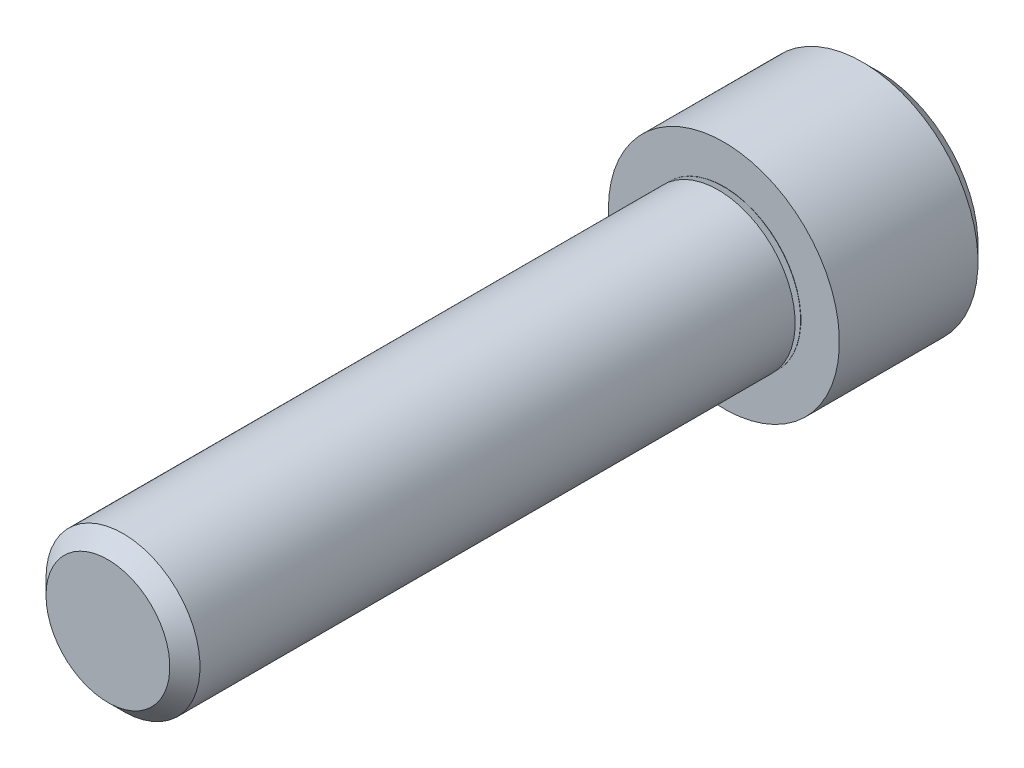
from build123d import *

# Parameters (mm, degrees)
CUT_EXTRUDE1_DEPTH = 3.175


with BuildPart() as part:
    # Logo3_bib1 → Revolve1 (revolve)
    with BuildSketch(Plane(origin=(0, 0, 0), x_dir=(-1, 0, 0), z_dir=(0, -1, 0))):
        with BuildLine():
            Line((0, -25.4), (0, 6.35))
            Line((0, 6.35), (4.1275, 6.35))
            Line((4.1275, 6.35), (4.7625, 5.715))
            Line((4.7625, 5.715), (4.7625, 0))
            Line((4.7625, 0), (3.175, 0))
            Line((3.175, 0), (3.175, -0.01))
            Line((3.175, -0.01), (2.666125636, -0.01))
            ThreePointArc((2.666125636, -0.01), (2.646429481, -0.026527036), (2.659285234, -0.048793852))
            Line((2.659285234, -0.048793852), (3.175, -0.236498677))
            Line((3.175, -0.236498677), (3.175, -24.7777))
            Line((3.175, -24.7777), (2.5527, -25.4))
            Line((2.5527, -25.4), (0, -25.4))
        make_face()
    revolve(axis=Axis((0, 0, -10.585154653), (0, 0, 1)))

    # Logo3_bib2 → Cut-Extrude1 (cut)
    with BuildSketch(Plane(origin=(0, 0, -6.35), x_dir=(1, 0, 0), z_dir=(0, 0, -1))):
        Polygon((2.749630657, 0), (1.374815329, 2.38125), (-1.374815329, 2.38125), (-2.749630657, 0), (-1.374815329, -2.38125), (1.374815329, -2.38125), align=None)
    extrude(amount=-CUT_EXTRUDE1_DEPTH, mode=Mode.SUBTRACT)


solid = part.part
